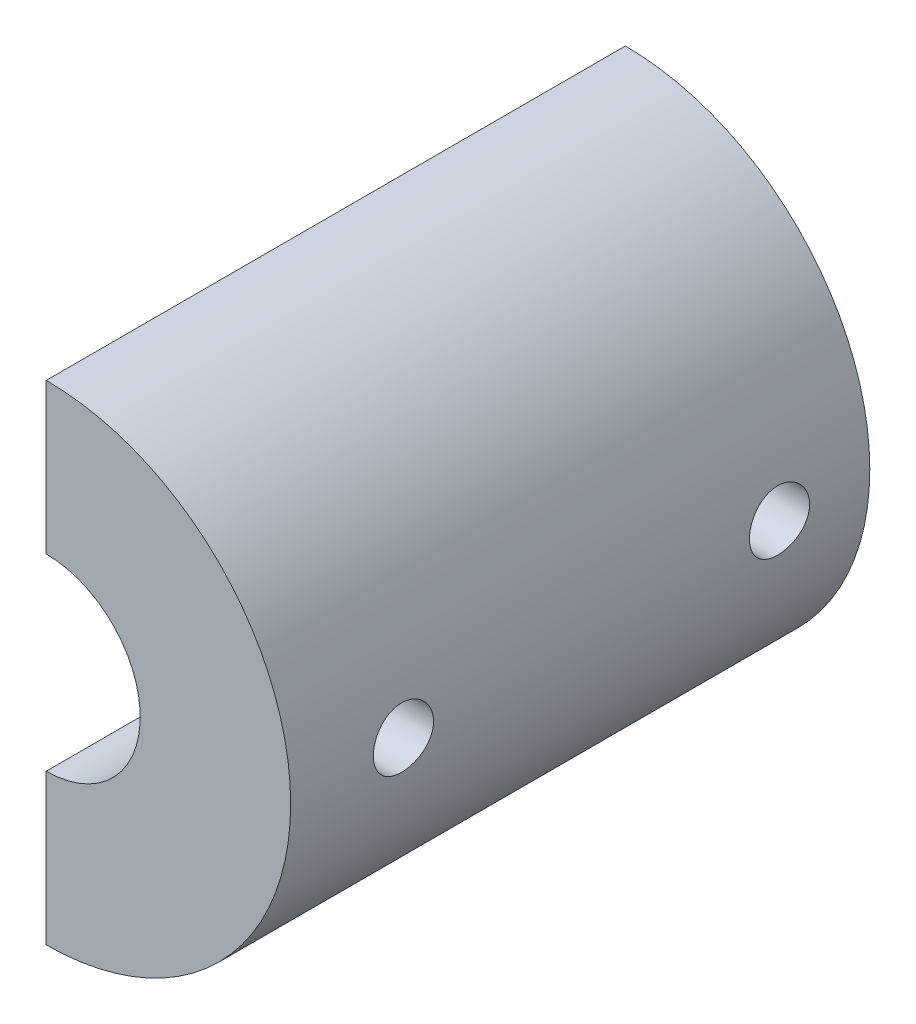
from build123d import *

# Parameters (mm, degrees)
BASE_EXTRUSION_DEPTH    = 77
ESQUISSE2_R             = 4
ENL_V_MAT_EXTRU_1_DEPTH = 80


with BuildPart() as part:
    # Esquisse1 → Base-Extrusion (new body)
    with BuildSketch(Plane.XY):
        with BuildLine():
            Line((0, 12.5), (0, 32.5))
            ThreePointArc((0, 32.5), (32.5, 0), (0, -32.5))
            Line((0, -32.5), (0, -12.5))
            ThreePointArc((0, -12.5), (12.5, 0), (0, 12.5))
        make_face()
    extrude(amount=BASE_EXTRUSION_DEPTH)

    # Esquisse2 → Enl_v. mat.-Extru.1 (cut)
    with BuildSketch(Plane.ZY):
        with Locations(Location((62, 0, 0), (0, 0, 270))):
            Circle(ESQUISSE2_R)
        with Locations(Location((12, 0, 0), (0, 0, 270))):
            Circle(ESQUISSE2_R)
    extrude(amount=-ENL_V_MAT_EXTRU_1_DEPTH, mode=Mode.SUBTRACT)


solid = part.part
